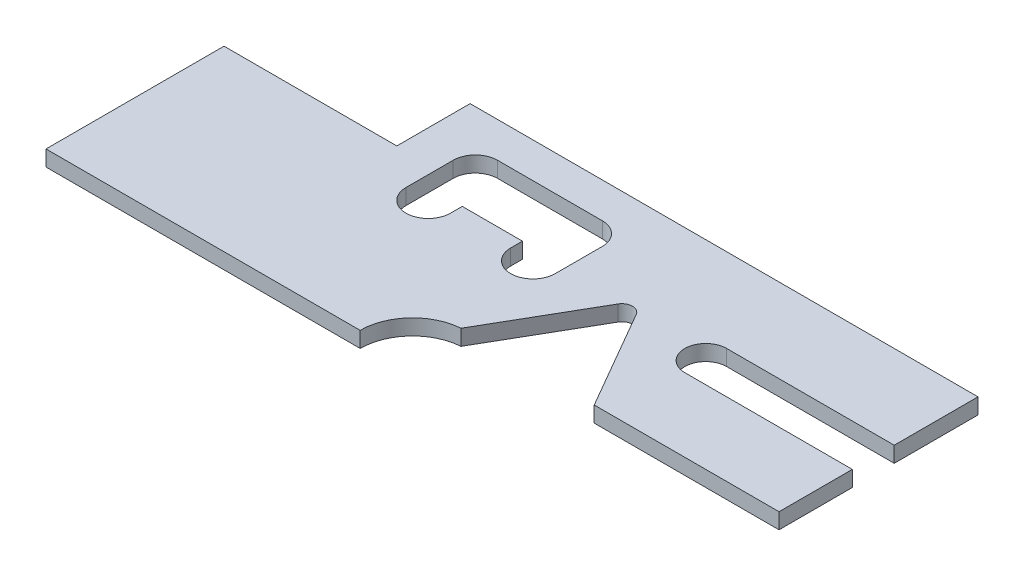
from build123d import *

# Parameters (mm, degrees)
EXTRUDE1_DEPTH = 3


with BuildPart() as part:
    # Sketch1 → Extrude1 (new body)
    with BuildSketch(Plane(origin=(0, 0, 0), x_dir=(1, 0, 0), z_dir=(0, 1, 0))):
        with BuildLine():
            Line((33, 48), (33, 34))
            Line((33, 34), (0, 34))
            Line((0, 34), (0, 0))
            Line((0, 0), (60, 0))
            ThreePointArc((60, 0), (62.679977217, 6.81302183), (69.283453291, 9.974295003))
            Line((69.283453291, 9.974295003), (80.267949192, 29))
            ThreePointArc((80.267949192, 29), (82, 30), (83.732050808, 29))
            Line((83.732050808, 29), (94.701705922, 10))
            Line((94.701705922, 10), (130, 10))
            Line((130, 10), (130, 24))
            Line((130, 24), (98, 24))
            ThreePointArc((98, 24), (94, 28), (98, 32))
            Line((98, 32), (130, 32))
            Line((130, 32), (130, 48))
            Line((130, 48), (33, 48))
        make_face()
        with BuildLine():
            Line((69.25, 28), (69.25, 37))
            ThreePointArc((69.25, 37), (68.00520382, 40.00520382), (65, 41.25))
            Line((65, 41.25), (45, 41.25))
            ThreePointArc((45, 41.25), (41.99479618, 40.00520382), (40.75, 37))
            Line((40.75, 37), (40.75, 28))
            ThreePointArc((40.75, 28), (45, 23.75), (49.25, 28))
            Line((49.25, 28), (49.25, 30.25))
            Line((49.25, 30.25), (60.75, 30.25))
            Line((60.75, 30.25), (60.75, 28))
            ThreePointArc((60.75, 28), (65, 23.75), (69.25, 28))
        make_face(mode=Mode.SUBTRACT)
    extrude(amount=EXTRUDE1_DEPTH)


solid = part.part
